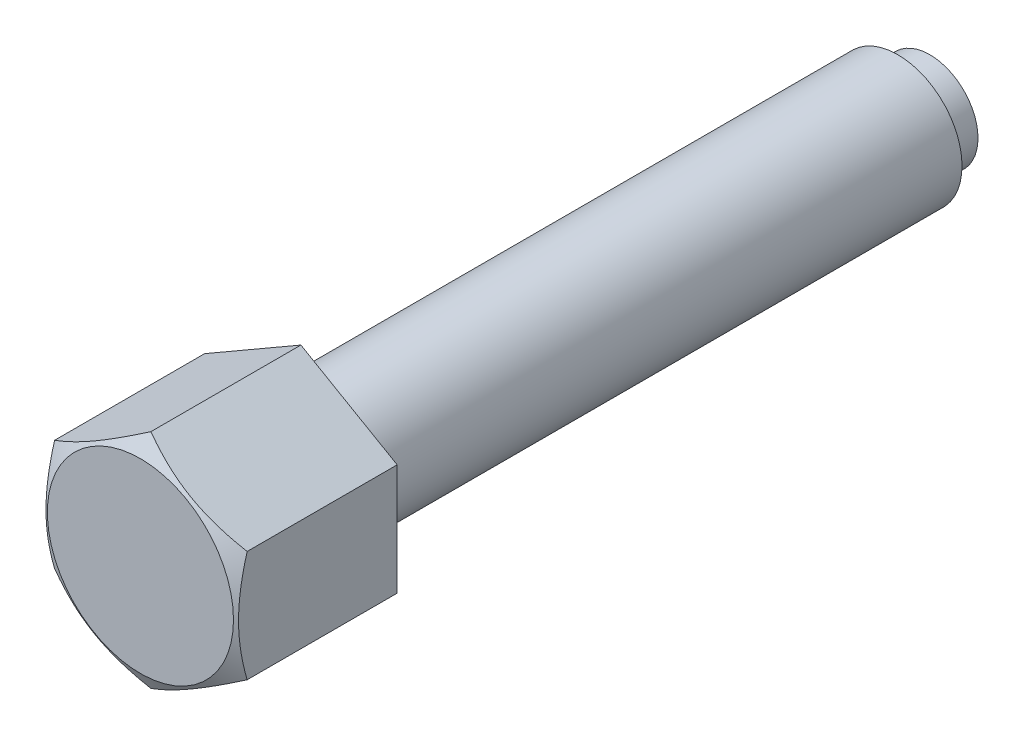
ISO-10303-21;
HEADER;
FILE_DESCRIPTION(('STEP AP214'),'2;1');
FILE_NAME('part.step','',(''),(''),'','','');
FILE_SCHEMA(('AUTOMOTIVE_DESIGN { 1 0 10303 214 1 1 1 1 }'));
ENDSEC;
DATA;
#1=APPLICATION_CONTEXT('core data for automotive mechanical design processes');
#2=APPLICATION_PROTOCOL_DEFINITION('international standard','automotive_design',2000,#1);
#3=PRODUCT_CONTEXT('',#1,'mechanical');
#4=PRODUCT('Part','Part','',(#3));
#5=PRODUCT_RELATED_PRODUCT_CATEGORY('part','',(#4));
#6=PRODUCT_DEFINITION_FORMATION('','',#4);
#7=PRODUCT_DEFINITION_CONTEXT('part definition',#1,'design');
#8=PRODUCT_DEFINITION('design','',#6,#7);
#9=PRODUCT_DEFINITION_SHAPE('','',#8);
#10=(LENGTH_UNIT() NAMED_UNIT(*) SI_UNIT(.MILLI.,.METRE.));
#11=(NAMED_UNIT(*) PLANE_ANGLE_UNIT() SI_UNIT($,.RADIAN.));
#12=(NAMED_UNIT(*) SI_UNIT($,.STERADIAN.) SOLID_ANGLE_UNIT());
#13=UNCERTAINTY_MEASURE_WITH_UNIT(LENGTH_MEASURE(1.E-05),#10,'distance_accuracy_value','');
#14=(GEOMETRIC_REPRESENTATION_CONTEXT(3) GLOBAL_UNCERTAINTY_ASSIGNED_CONTEXT((#13)) GLOBAL_UNIT_ASSIGNED_CONTEXT((#10,
#11,#12)) REPRESENTATION_CONTEXT('',''));
#15=CARTESIAN_POINT('',(0.,0.,0.));
#16=DIRECTION('',(0.,0.,1.));
#17=DIRECTION('',(1.,0.,0.));
#18=AXIS2_PLACEMENT_3D('',#15,#16,#17);
#19=CARTESIAN_POINT('',(0.,17.3205080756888,95.));
#20=DIRECTION('',(-0.5,-0.86602540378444,0.));
#21=DIRECTION('',(0.86602540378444,-0.5,0.));
#22=AXIS2_PLACEMENT_3D('',#19,#20,#21);
#23=PLANE('',#22);
#24=CARTESIAN_POINT('',(15.0002,8.66013856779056,123.371512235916));
#25=CARTESIAN_POINT('',(14.6705058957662,8.85048754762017,123.481403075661));
#26=CARTESIAN_POINT('',(14.3395258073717,9.04157899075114,123.586307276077));
#27=CARTESIAN_POINT('',(13.674911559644,9.425294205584,123.784756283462));
#28=CARTESIAN_POINT('',(13.3412765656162,9.61791845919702,123.878297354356));
#29=CARTESIAN_POINT('',(12.6707077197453,10.0050715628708,124.052762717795));
#30=CARTESIAN_POINT('',(12.333767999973,10.199603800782,124.133657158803));
#31=CARTESIAN_POINT('',(11.6575472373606,10.5900200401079,124.281092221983));
#32=CARTESIAN_POINT('',(11.3182663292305,10.7859039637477,124.347633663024));
#33=CARTESIAN_POINT('',(10.6460568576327,11.1740042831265,124.463532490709));
#34=CARTESIAN_POINT('',(10.3131781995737,11.3661918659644,124.513273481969));
#35=CARTESIAN_POINT('',(9.6458955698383,11.7514476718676,124.596678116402));
#36=CARTESIAN_POINT('',(9.3114915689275,11.9445159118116,124.630341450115));
#37=CARTESIAN_POINT('',(8.64212181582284,12.3309767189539,124.680740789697));
#38=CARTESIAN_POINT('',(8.30715720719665,12.5243686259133,124.697496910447));
#39=CARTESIAN_POINT('',(7.63691878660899,12.9113309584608,124.713721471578));
#40=CARTESIAN_POINT('',(7.30164498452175,13.1049013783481,124.713190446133));
#41=CARTESIAN_POINT('',(6.6748531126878,13.4667798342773,124.696048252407));
#42=CARTESIAN_POINT('',(6.38329037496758,13.6351136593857,124.681528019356));
#43=CARTESIAN_POINT('',(5.80083556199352,13.9713941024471,124.639687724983));
#44=CARTESIAN_POINT('',(5.50994353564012,14.1393406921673,124.612366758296));
#45=CARTESIAN_POINT('',(4.92898814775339,14.4747554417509,124.545401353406));
#46=CARTESIAN_POINT('',(4.63892567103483,14.6422230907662,124.505746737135));
#47=CARTESIAN_POINT('',(4.06016058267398,14.9763732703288,124.414809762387));
#48=CARTESIAN_POINT('',(3.77145806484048,15.1430557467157,124.363526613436));
#49=CARTESIAN_POINT('',(2.89508556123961,15.6490296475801,124.190938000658));
#50=CARTESIAN_POINT('',(2.30995340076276,15.9868558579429,124.052423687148));
#51=CARTESIAN_POINT('',(1.14841408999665,16.657470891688,123.73805289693));
#52=CARTESIAN_POINT('',(0.571992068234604,16.9902683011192,123.562270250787));
#53=CARTESIAN_POINT('',(-0.000199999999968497,17.3206235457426,123.371512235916));
#54=B_SPLINE_CURVE_WITH_KNOTS('',3,(#24,#25,#26,#27,#28,#29,#30,#31,#32,#33,#34,#35,#36,#37,#38,
#39,#40,#41,#42,#43,#44,#45,#46,#47,#48,#49,#50,#51,#52,#53),.UNSPECIFIED.,.F.,.F.,(4,2,2,2,2,2,
2,2,2,2,2,2,2,2,4),(0.,1.18875411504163,2.37789802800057,3.56980778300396,4.76164951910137,
5.9240737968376,7.08652044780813,8.24758247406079,9.40860862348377,10.4193068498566,
11.4300765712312,12.4416826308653,13.4533574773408,15.5211962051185,17.5849760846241),.UNSPECIFIED.);
#55=CARTESIAN_POINT('',(15.,8.66025403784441,123.37157890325));
#56=VERTEX_POINT('',#55);
#57=CARTESIAN_POINT('',(0.,17.3205080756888,123.37157890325));
#58=VERTEX_POINT('',#57);
#59=EDGE_CURVE('E29',#56,#58,#54,.T.);
#60=ORIENTED_EDGE('',*,*,#59,.F.);
#61=DIRECTION('',(0.,0.,1.));
#62=VECTOR('',#61,1.);
#63=CARTESIAN_POINT('',(15.,8.66025403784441,95.));
#64=LINE('',#63,#62);
#65=CARTESIAN_POINT('',(15.,8.66025403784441,100.));
#66=VERTEX_POINT('',#65);
#67=EDGE_CURVE('E96',#66,#56,#64,.T.);
#68=ORIENTED_EDGE('',*,*,#67,.F.);
#69=DIRECTION('',(0.86602540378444,-0.5,0.));
#70=VECTOR('',#69,1.);
#71=CARTESIAN_POINT('',(15.,8.66025403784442,100.));
#72=LINE('',#71,#70);
#73=CARTESIAN_POINT('',(0.,17.3205080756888,100.));
#74=VERTEX_POINT('',#73);
#75=EDGE_CURVE('E110',#74,#66,#72,.T.);
#76=ORIENTED_EDGE('',*,*,#75,.F.);
#77=DIRECTION('',(0.,0.,1.));
#78=VECTOR('',#77,1.);
#79=CARTESIAN_POINT('',(0.,17.3205080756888,95.));
#80=LINE('',#79,#78);
#81=EDGE_CURVE('E36',#74,#58,#80,.T.);
#82=ORIENTED_EDGE('',*,*,#81,.T.);
#83=EDGE_LOOP('',(#60,#68,#76,#82));
#84=FACE_BOUND('',#83,.T.);
#85=ADVANCED_FACE('F14',(#84),#23,.F.);
#86=CARTESIAN_POINT('',(15.,8.66025403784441,95.));
#87=DIRECTION('',(-1.,0.,0.));
#88=DIRECTION('',(0.,-1.,0.));
#89=AXIS2_PLACEMENT_3D('',#86,#87,#88);
#90=PLANE('',#89);
#91=CARTESIAN_POINT('',(15.,-23.3021585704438,117.371676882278));
#92=CARTESIAN_POINT('',(15.,-22.9744289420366,117.530774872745));
#93=CARTESIAN_POINT('',(15.,-22.6463158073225,117.68908249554));
#94=CARTESIAN_POINT('',(15.,-21.9892425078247,118.003938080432));
#95=CARTESIAN_POINT('',(15.,-21.6602823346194,118.160486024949));
#96=CARTESIAN_POINT('',(15.,-20.6719241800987,118.627262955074));
#97=CARTESIAN_POINT('',(15.,-20.0111448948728,118.934578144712));
#98=CARTESIAN_POINT('',(15.,-18.681600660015,119.541233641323));
#99=CARTESIAN_POINT('',(15.,-18.0128118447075,119.840521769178));
#100=CARTESIAN_POINT('',(15.,-16.6699294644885,120.426907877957));
#101=CARTESIAN_POINT('',(15.,-15.9958361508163,120.71400643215));
#102=CARTESIAN_POINT('',(15.,-14.6193622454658,121.281827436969));
#103=CARTESIAN_POINT('',(15.,-13.9167717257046,121.562043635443));
#104=CARTESIAN_POINT('',(15.,-12.5033805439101,122.101365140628));
#105=CARTESIAN_POINT('',(15.,-11.7925789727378,122.360468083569));
#106=CARTESIAN_POINT('',(15.,-10.3629755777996,122.850786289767));
#107=CARTESIAN_POINT('',(15.,-9.64419315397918,123.082057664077));
#108=CARTESIAN_POINT('',(15.,-8.19624965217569,123.509330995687));
#109=CARTESIAN_POINT('',(15.,-7.46709190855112,123.705344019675));
#110=CARTESIAN_POINT('',(15.,-6.36746139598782,123.965310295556));
#111=CARTESIAN_POINT('',(15.,-6.00094855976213,124.046114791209));
#112=CARTESIAN_POINT('',(15.,-5.26541113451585,124.195413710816));
#113=CARTESIAN_POINT('',(15.,-4.89638659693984,124.263908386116));
#114=CARTESIAN_POINT('',(15.,-4.15607644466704,124.387381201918));
#115=CARTESIAN_POINT('',(15.,-3.78479085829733,124.442359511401));
#116=CARTESIAN_POINT('',(15.,-3.04035132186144,124.537703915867));
#117=CARTESIAN_POINT('',(15.,-2.6671974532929,124.578070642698));
#118=CARTESIAN_POINT('',(15.,-1.92443022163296,124.642882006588));
#119=CARTESIAN_POINT('',(15.,-1.55483457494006,124.667528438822));
#120=CARTESIAN_POINT('',(15.,-0.814932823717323,124.701167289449));
#121=CARTESIAN_POINT('',(15.,-0.444626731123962,124.710159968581));
#122=CARTESIAN_POINT('',(15.,0.296035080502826,124.712277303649));
#123=CARTESIAN_POINT('',(15.,0.666390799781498,124.705401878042));
#124=CARTESIAN_POINT('',(15.,1.40648151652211,124.675951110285));
#125=CARTESIAN_POINT('',(15.,1.77621648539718,124.653375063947));
#126=CARTESIAN_POINT('',(15.,2.66358936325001,124.580830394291));
#127=CARTESIAN_POINT('',(15.,3.18063448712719,124.52348000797));
#128=CARTESIAN_POINT('',(15.,4.21091672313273,124.381189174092));
#129=CARTESIAN_POINT('',(15.,4.72415331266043,124.296245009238));
#130=CARTESIAN_POINT('',(15.,5.74631863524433,124.101788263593));
#131=CARTESIAN_POINT('',(15.,6.25524371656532,123.992256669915));
#132=CARTESIAN_POINT('',(15.,7.26800314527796,123.751969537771));
#133=CARTESIAN_POINT('',(15.,7.771837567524,123.621214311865));
#134=CARTESIAN_POINT('',(15.,8.78554955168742,123.33855845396));
#135=CARTESIAN_POINT('',(15.,9.29531356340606,123.186253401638));
#136=CARTESIAN_POINT('',(15.,10.3098201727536,122.865833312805));
#137=CARTESIAN_POINT('',(15.,10.8145627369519,122.697718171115));
#138=CARTESIAN_POINT('',(15.,11.8192749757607,122.34835373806));
#139=CARTESIAN_POINT('',(15.,12.3192461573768,122.16710876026));
#140=CARTESIAN_POINT('',(15.,13.3150402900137,121.793624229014));
#141=CARTESIAN_POINT('',(15.,13.8108632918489,121.601384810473));
#142=CARTESIAN_POINT('',(15.,14.9898051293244,121.131641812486));
#143=CARTESIAN_POINT('',(15.,15.6712346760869,120.84990466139));
#144=CARTESIAN_POINT('',(15.,17.0282247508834,120.272593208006));
#145=CARTESIAN_POINT('',(15.,17.7037848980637,119.977018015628));
#146=CARTESIAN_POINT('',(15.,19.0501440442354,119.374831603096));
#147=CARTESIAN_POINT('',(15.,19.720941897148,119.068217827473));
#148=CARTESIAN_POINT('',(15.,21.058423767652,118.446206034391));
#149=CARTESIAN_POINT('',(15.,21.7251078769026,118.13080821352));
#150=CARTESIAN_POINT('',(15.,23.0558018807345,117.492528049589));
#151=CARTESIAN_POINT('',(15.,23.7198079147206,117.169637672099));
#152=CARTESIAN_POINT('',(15.,25.0449427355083,116.51800669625));
#153=CARTESIAN_POINT('',(15.,25.7060715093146,116.189266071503));
#154=CARTESIAN_POINT('',(15.,27.0258097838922,115.526991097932));
#155=CARTESIAN_POINT('',(15.,27.6844196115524,115.193457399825));
#156=CARTESIAN_POINT('',(15.,28.9995758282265,114.522344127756));
#157=CARTESIAN_POINT('',(15.,29.6561222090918,114.184764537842));
#158=CARTESIAN_POINT('',(15.,31.5114137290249,113.224742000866));
#159=CARTESIAN_POINT('',(15.,32.7080977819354,112.598316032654));
#160=CARTESIAN_POINT('',(15.,35.0970376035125,111.336990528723));
#161=CARTESIAN_POINT('',(15.,36.2892932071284,110.702090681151));
#162=CARTESIAN_POINT('',(15.,38.6672972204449,109.427440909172));
#163=CARTESIAN_POINT('',(15.,39.8530544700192,108.787707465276));
#164=CARTESIAN_POINT('',(15.,41.6296063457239,107.824348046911));
#165=CARTESIAN_POINT('',(15.,42.2214266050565,107.502610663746));
#166=CARTESIAN_POINT('',(15.,43.4044517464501,106.858008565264));
#167=CARTESIAN_POINT('',(15.,43.995656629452,106.535143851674));
#168=CARTESIAN_POINT('',(15.,44.5865888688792,106.211780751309));
#169=B_SPLINE_CURVE_WITH_KNOTS('',3,(#91,#92,#93,#94,#95,#96,#97,#98,#99,#100,#101,#102,#103,
#104,#105,#106,#107,#108,#109,#110,#111,#112,#113,#114,#115,#116,#117,#118,#119,#120,#121,#122,
#123,#124,#125,#126,#127,#128,#129,#130,#131,#132,#133,#134,#135,#136,#137,#138,#139,#140,#141,
#142,#143,#144,#145,#146,#147,#148,#149,#150,#151,#152,#153,#154,#155,#156,#157,#158,#159,#160,
#161,#162,#163,#164,#165,#166,#167,#168),.UNSPECIFIED.,.F.,.F.,(4,2,2,2,2,2,2,2,2,2,2,2,2,2,2,2,
2,2,2,2,2,2,2,2,2,2,2,2,2,2,2,2,2,2,2,2,2,2,4),(0.,1.09291610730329,2.18584312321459,
4.37201855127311,6.57002901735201,8.76793599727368,11.0369038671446,13.3061254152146,
15.5706925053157,17.8345475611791,18.9603179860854,20.0860654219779,21.2117987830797,
22.3374834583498,23.4484108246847,24.5593196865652,25.6702342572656,26.7811986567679,
28.3409846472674,29.9009808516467,31.4621875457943,33.0233712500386,34.6191556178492,
36.2149506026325,37.8102236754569,39.4054771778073,41.617393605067,43.8294525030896,
46.0420268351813,48.2545516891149,50.469570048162,52.6845984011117,54.8993288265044,
57.1140679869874,61.1661961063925,65.2184737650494,69.2604259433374,71.2812900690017,
73.3021511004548),.UNSPECIFIED.);
#170=CARTESIAN_POINT('',(15.,-8.66025403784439,123.37157890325));
#171=VERTEX_POINT('',#170);
#172=EDGE_CURVE('E156',#171,#56,#169,.T.);
#173=ORIENTED_EDGE('',*,*,#172,.F.);
#174=DIRECTION('',(0.,0.,1.));
#175=VECTOR('',#174,1.);
#176=CARTESIAN_POINT('',(15.,-8.66025403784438,95.));
#177=LINE('',#176,#175);
#178=CARTESIAN_POINT('',(15.,-8.66025403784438,100.));
#179=VERTEX_POINT('',#178);
#180=EDGE_CURVE('E93',#179,#171,#177,.T.);
#181=ORIENTED_EDGE('',*,*,#180,.F.);
#182=DIRECTION('',(0.,-1.,0.));
#183=VECTOR('',#182,1.);
#184=CARTESIAN_POINT('',(15.,0.,100.));
#185=LINE('',#184,#183);
#186=EDGE_CURVE('E107',#66,#179,#185,.T.);
#187=ORIENTED_EDGE('',*,*,#186,.F.);
#188=ORIENTED_EDGE('',*,*,#67,.T.);
#189=EDGE_LOOP('',(#173,#181,#187,#188));
#190=FACE_BOUND('',#189,.T.);
#191=ADVANCED_FACE('F136',(#190),#90,.F.);
#192=CARTESIAN_POINT('',(0.,-17.3205080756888,95.));
#193=DIRECTION('',(0.5,-0.866025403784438,0.));
#194=DIRECTION('',(0.866025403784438,0.5,0.));
#195=AXIS2_PLACEMENT_3D('',#192,#193,#194);
#196=PLANE('',#195);
#197=ORIENTED_EDGE('',*,*,#180,.T.);
#198=CARTESIAN_POINT('',(15.0002,-8.66013856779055,123.371512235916));
#199=CARTESIAN_POINT('',(14.6705058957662,-8.85048754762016,123.481403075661));
#200=CARTESIAN_POINT('',(14.3395258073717,-9.04157899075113,123.586307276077));
#201=CARTESIAN_POINT('',(13.674911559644,-9.42529420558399,123.784756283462));
#202=CARTESIAN_POINT('',(13.3412765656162,-9.61791845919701,123.878297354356));
#203=CARTESIAN_POINT('',(12.6707077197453,-10.0050715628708,124.052762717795));
#204=CARTESIAN_POINT('',(12.333767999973,-10.199603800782,124.133657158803));
#205=CARTESIAN_POINT('',(11.6575472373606,-10.5900200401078,124.281092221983));
#206=CARTESIAN_POINT('',(11.3182663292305,-10.7859039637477,124.347633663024));
#207=CARTESIAN_POINT('',(10.6460568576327,-11.1740042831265,124.463532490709));
#208=CARTESIAN_POINT('',(10.3131781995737,-11.3661918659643,124.513273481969));
#209=CARTESIAN_POINT('',(9.64589556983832,-11.7514476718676,124.596678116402));
#210=CARTESIAN_POINT('',(9.31149156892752,-11.9445159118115,124.630341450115));
#211=CARTESIAN_POINT('',(8.64212181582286,-12.3309767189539,124.680740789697));
#212=CARTESIAN_POINT('',(8.30715720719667,-12.5243686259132,124.697496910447));
#213=CARTESIAN_POINT('',(7.63691878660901,-12.9113309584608,124.713721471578));
#214=CARTESIAN_POINT('',(7.30164498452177,-13.104901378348,124.713190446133));
#215=CARTESIAN_POINT('',(6.67485311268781,-13.4667798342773,124.696048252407));
#216=CARTESIAN_POINT('',(6.38329037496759,-13.6351136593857,124.681528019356));
#217=CARTESIAN_POINT('',(5.80083556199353,-13.9713941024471,124.639687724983));
#218=CARTESIAN_POINT('',(5.50994353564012,-14.1393406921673,124.612366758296));
#219=CARTESIAN_POINT('',(4.92898814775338,-14.4747554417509,124.545401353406));
#220=CARTESIAN_POINT('',(4.63892567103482,-14.6422230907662,124.505746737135));
#221=CARTESIAN_POINT('',(4.06016058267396,-14.9763732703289,124.414809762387));
#222=CARTESIAN_POINT('',(3.77145806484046,-15.1430557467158,124.363526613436));
#223=CARTESIAN_POINT('',(2.89508556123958,-15.6490296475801,124.190938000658));
#224=CARTESIAN_POINT('',(2.30995340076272,-15.9868558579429,124.052423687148));
#225=CARTESIAN_POINT('',(1.1484140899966,-16.6574708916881,123.73805289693));
#226=CARTESIAN_POINT('',(0.571992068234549,-16.9902683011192,123.562270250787));
#227=CARTESIAN_POINT('',(-0.000200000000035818,-17.3206235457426,123.371512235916));
#228=B_SPLINE_CURVE_WITH_KNOTS('',3,(#198,#199,#200,#201,#202,#203,#204,#205,#206,#207,#208,
#209,#210,#211,#212,#213,#214,#215,#216,#217,#218,#219,#220,#221,#222,#223,#224,#225,#226,#227),
.UNSPECIFIED.,.F.,.F.,(4,2,2,2,2,2,2,2,2,2,2,2,2,2,4),(0.,1.18875411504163,2.37789802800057,
3.56980778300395,4.76164951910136,5.92407379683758,7.08652044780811,8.24758247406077,
9.40860862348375,10.4193068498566,11.4300765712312,12.4416826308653,13.4533574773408,
15.5211962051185,17.5849760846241),.UNSPECIFIED.);
#229=CARTESIAN_POINT('',(0.,-17.3205080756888,123.37157890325));
#230=VERTEX_POINT('',#229);
#231=EDGE_CURVE('E162',#171,#230,#228,.T.);
#232=ORIENTED_EDGE('',*,*,#231,.T.);
#233=DIRECTION('',(0.,0.,1.));
#234=VECTOR('',#233,1.);
#235=CARTESIAN_POINT('',(0.,-17.3205080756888,95.));
#236=LINE('',#235,#234);
#237=CARTESIAN_POINT('',(0.,-17.3205080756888,100.));
#238=VERTEX_POINT('',#237);
#239=EDGE_CURVE('E86',#238,#230,#236,.T.);
#240=ORIENTED_EDGE('',*,*,#239,.F.);
#241=DIRECTION('',(0.866025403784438,0.5,0.));
#242=VECTOR('',#241,1.);
#243=CARTESIAN_POINT('',(15.,-8.66025403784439,100.));
#244=LINE('',#243,#242);
#245=EDGE_CURVE('E105',#238,#179,#244,.T.);
#246=ORIENTED_EDGE('',*,*,#245,.T.);
#247=EDGE_LOOP('',(#197,#232,#240,#246));
#248=FACE_BOUND('',#247,.T.);
#249=ADVANCED_FACE('F142',(#248),#196,.T.);
#250=CARTESIAN_POINT('',(0.,-17.3205080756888,95.));
#251=DIRECTION('',(0.5,0.866025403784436,0.));
#252=DIRECTION('',(-0.866025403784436,0.5,0.));
#253=AXIS2_PLACEMENT_3D('',#250,#251,#252);
#254=PLANE('',#253);
#255=CARTESIAN_POINT('',(-15.0002,-8.66013856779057,123.371512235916));
#256=CARTESIAN_POINT('',(-14.6705058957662,-8.85048754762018,123.481403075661));
#257=CARTESIAN_POINT('',(-14.3395258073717,-9.04157899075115,123.586307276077));
#258=CARTESIAN_POINT('',(-13.674911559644,-9.42529420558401,123.784756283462));
#259=CARTESIAN_POINT('',(-13.3412765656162,-9.61791845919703,123.878297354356));
#260=CARTESIAN_POINT('',(-12.6707077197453,-10.0050715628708,124.052762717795));
#261=CARTESIAN_POINT('',(-12.333767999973,-10.199603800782,124.133657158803));
#262=CARTESIAN_POINT('',(-11.6575472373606,-10.5900200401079,124.281092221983));
#263=CARTESIAN_POINT('',(-11.3182663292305,-10.7859039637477,124.347633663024));
#264=CARTESIAN_POINT('',(-10.6460568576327,-11.1740042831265,124.463532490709));
#265=CARTESIAN_POINT('',(-10.3131781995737,-11.3661918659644,124.513273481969));
#266=CARTESIAN_POINT('',(-9.64589556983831,-11.7514476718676,124.596678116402));
#267=CARTESIAN_POINT('',(-9.31149156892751,-11.9445159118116,124.630341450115));
#268=CARTESIAN_POINT('',(-8.64212181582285,-12.3309767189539,124.680740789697));
#269=CARTESIAN_POINT('',(-8.30715720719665,-12.5243686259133,124.697496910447));
#270=CARTESIAN_POINT('',(-7.636918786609,-12.9113309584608,124.713721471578));
#271=CARTESIAN_POINT('',(-7.30164498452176,-13.1049013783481,124.713190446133));
#272=CARTESIAN_POINT('',(-6.67485311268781,-13.4667798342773,124.696048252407));
#273=CARTESIAN_POINT('',(-6.38329037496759,-13.6351136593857,124.681528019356));
#274=CARTESIAN_POINT('',(-5.80083556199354,-13.9713941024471,124.639687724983));
#275=CARTESIAN_POINT('',(-5.50994353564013,-14.1393406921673,124.612366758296));
#276=CARTESIAN_POINT('',(-4.9289881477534,-14.4747554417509,124.545401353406));
#277=CARTESIAN_POINT('',(-4.63892567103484,-14.6422230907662,124.505746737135));
#278=CARTESIAN_POINT('',(-4.06016058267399,-14.9763732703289,124.414809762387));
#279=CARTESIAN_POINT('',(-3.77145806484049,-15.1430557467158,124.363526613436));
#280=CARTESIAN_POINT('',(-2.89508556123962,-15.6490296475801,124.190938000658));
#281=CARTESIAN_POINT('',(-2.30995340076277,-15.9868558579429,124.052423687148));
#282=CARTESIAN_POINT('',(-1.14841408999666,-16.6574708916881,123.73805289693));
#283=CARTESIAN_POINT('',(-0.571992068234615,-16.9902683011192,123.562270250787));
#284=CARTESIAN_POINT('',(0.00019999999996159,-17.3206235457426,123.371512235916));
#285=B_SPLINE_CURVE_WITH_KNOTS('',3,(#255,#256,#257,#258,#259,#260,#261,#262,#263,#264,#265,
#266,#267,#268,#269,#270,#271,#272,#273,#274,#275,#276,#277,#278,#279,#280,#281,#282,#283,#284),
.UNSPECIFIED.,.F.,.F.,(4,2,2,2,2,2,2,2,2,2,2,2,2,2,4),(0.,1.18875411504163,2.37789802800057,
3.56980778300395,4.76164951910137,5.9240737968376,7.08652044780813,8.24758247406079,
9.40860862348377,10.4193068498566,11.4300765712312,12.4416826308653,13.4533574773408,
15.5211962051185,17.5849760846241),.UNSPECIFIED.);
#286=CARTESIAN_POINT('',(-15.,-8.66025403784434,123.37157890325));
#287=VERTEX_POINT('',#286);
#288=EDGE_CURVE('E80',#287,#230,#285,.T.);
#289=ORIENTED_EDGE('',*,*,#288,.F.);
#290=DIRECTION('',(0.,0.,1.));
#291=VECTOR('',#290,1.);
#292=CARTESIAN_POINT('',(-15.,-8.66025403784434,95.));
#293=LINE('',#292,#291);
#294=CARTESIAN_POINT('',(-15.,-8.66025403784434,100.));
#295=VERTEX_POINT('',#294);
#296=EDGE_CURVE('E79',#295,#287,#293,.T.);
#297=ORIENTED_EDGE('',*,*,#296,.F.);
#298=DIRECTION('',(-0.866025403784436,0.5,0.));
#299=VECTOR('',#298,1.);
#300=CARTESIAN_POINT('',(-1.17961196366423E-13,-17.3205080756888,100.));
#301=LINE('',#300,#299);
#302=EDGE_CURVE('E102',#238,#295,#301,.T.);
#303=ORIENTED_EDGE('',*,*,#302,.F.);
#304=ORIENTED_EDGE('',*,*,#239,.T.);
#305=EDGE_LOOP('',(#289,#297,#303,#304));
#306=FACE_BOUND('',#305,.T.);
#307=ADVANCED_FACE('F238',(#306),#254,.F.);
#308=CARTESIAN_POINT('',(-15.,8.66025403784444,95.));
#309=DIRECTION('',(-1.,0.,0.));
#310=DIRECTION('',(0.,0.,1.));
#311=AXIS2_PLACEMENT_3D('',#308,#309,#310);
#312=PLANE('',#311);
#313=ORIENTED_EDGE('',*,*,#296,.T.);
#314=CARTESIAN_POINT('',(-15.,-23.3021585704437,117.371676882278));
#315=CARTESIAN_POINT('',(-15.,-22.9744289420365,117.530774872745));
#316=CARTESIAN_POINT('',(-15.,-22.6463158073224,117.68908249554));
#317=CARTESIAN_POINT('',(-15.,-21.9892425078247,118.003938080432));
#318=CARTESIAN_POINT('',(-15.,-21.6602823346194,118.160486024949));
#319=CARTESIAN_POINT('',(-15.,-20.6719241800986,118.627262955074));
#320=CARTESIAN_POINT('',(-15.,-20.0111448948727,118.934578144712));
#321=CARTESIAN_POINT('',(-15.,-18.681600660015,119.541233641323));
#322=CARTESIAN_POINT('',(-15.,-18.0128118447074,119.840521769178));
#323=CARTESIAN_POINT('',(-15.,-16.6699294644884,120.426907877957));
#324=CARTESIAN_POINT('',(-15.,-15.9958361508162,120.71400643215));
#325=CARTESIAN_POINT('',(-15.,-14.6193622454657,121.281827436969));
#326=CARTESIAN_POINT('',(-15.,-13.9167717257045,121.562043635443));
#327=CARTESIAN_POINT('',(-15.,-12.5033805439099,122.101365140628));
#328=CARTESIAN_POINT('',(-15.,-11.7925789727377,122.360468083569));
#329=CARTESIAN_POINT('',(-15.,-10.3629755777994,122.850786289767));
#330=CARTESIAN_POINT('',(-15.,-9.64419315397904,123.082057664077));
#331=CARTESIAN_POINT('',(-15.,-8.1962496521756,123.509330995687));
#332=CARTESIAN_POINT('',(-15.,-7.46709190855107,123.705344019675));
#333=CARTESIAN_POINT('',(-15.,-6.36746139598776,123.965310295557));
#334=CARTESIAN_POINT('',(-15.,-6.00094855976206,124.046114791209));
#335=CARTESIAN_POINT('',(-15.,-5.26541113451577,124.195413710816));
#336=CARTESIAN_POINT('',(-15.,-4.89638659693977,124.263908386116));
#337=CARTESIAN_POINT('',(-15.,-4.15607644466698,124.387381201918));
#338=CARTESIAN_POINT('',(-15.,-3.78479085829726,124.442359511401));
#339=CARTESIAN_POINT('',(-15.,-3.04035132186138,124.537703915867));
#340=CARTESIAN_POINT('',(-15.,-2.66719745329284,124.578070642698));
#341=CARTESIAN_POINT('',(-15.,-1.92443022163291,124.642882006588));
#342=CARTESIAN_POINT('',(-15.,-1.55483457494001,124.667528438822));
#343=CARTESIAN_POINT('',(-15.,-0.814932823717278,124.701167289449));
#344=CARTESIAN_POINT('',(-15.,-0.444626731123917,124.710159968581));
#345=CARTESIAN_POINT('',(-15.,0.296035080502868,124.712277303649));
#346=CARTESIAN_POINT('',(-15.,0.666390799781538,124.705401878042));
#347=CARTESIAN_POINT('',(-15.,1.40648151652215,124.675951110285));
#348=CARTESIAN_POINT('',(-15.,1.77621648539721,124.653375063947));
#349=CARTESIAN_POINT('',(-15.,2.66358936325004,124.580830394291));
#350=CARTESIAN_POINT('',(-15.,3.18063448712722,124.52348000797));
#351=CARTESIAN_POINT('',(-15.,4.21091672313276,124.381189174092));
#352=CARTESIAN_POINT('',(-15.,4.72415331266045,124.296245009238));
#353=CARTESIAN_POINT('',(-15.,5.74631863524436,124.101788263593));
#354=CARTESIAN_POINT('',(-15.,6.25524371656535,123.992256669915));
#355=CARTESIAN_POINT('',(-15.,7.268003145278,123.751969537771));
#356=CARTESIAN_POINT('',(-15.,7.77183756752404,123.621214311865));
#357=CARTESIAN_POINT('',(-15.,8.78554955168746,123.33855845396));
#358=CARTESIAN_POINT('',(-15.,9.29531356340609,123.186253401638));
#359=CARTESIAN_POINT('',(-15.,10.3098201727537,122.865833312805));
#360=CARTESIAN_POINT('',(-15.,10.8145627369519,122.697718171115));
#361=CARTESIAN_POINT('',(-15.,11.8192749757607,122.34835373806));
#362=CARTESIAN_POINT('',(-15.,12.3192461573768,122.16710876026));
#363=CARTESIAN_POINT('',(-15.,13.3150402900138,121.793624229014));
#364=CARTESIAN_POINT('',(-15.,13.810863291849,121.601384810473));
#365=CARTESIAN_POINT('',(-15.,14.9898051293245,121.131641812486));
#366=CARTESIAN_POINT('',(-15.,15.6712346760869,120.84990466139));
#367=CARTESIAN_POINT('',(-15.,17.0282247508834,120.272593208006));
#368=CARTESIAN_POINT('',(-15.,17.7037848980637,119.977018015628));
#369=CARTESIAN_POINT('',(-15.,19.0501440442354,119.374831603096));
#370=CARTESIAN_POINT('',(-15.,19.720941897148,119.068217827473));
#371=CARTESIAN_POINT('',(-15.,21.058423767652,118.446206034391));
#372=CARTESIAN_POINT('',(-15.,21.7251078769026,118.13080821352));
#373=CARTESIAN_POINT('',(-15.,23.0558018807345,117.492528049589));
#374=CARTESIAN_POINT('',(-15.,23.7198079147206,117.169637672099));
#375=CARTESIAN_POINT('',(-15.,25.0449427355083,116.51800669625));
#376=CARTESIAN_POINT('',(-15.,25.7060715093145,116.189266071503));
#377=CARTESIAN_POINT('',(-15.,27.0258097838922,115.526991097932));
#378=CARTESIAN_POINT('',(-15.,27.6844196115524,115.193457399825));
#379=CARTESIAN_POINT('',(-15.,28.9995758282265,114.522344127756));
#380=CARTESIAN_POINT('',(-15.,29.6561222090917,114.184764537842));
#381=CARTESIAN_POINT('',(-15.,31.5114137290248,113.224742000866));
#382=CARTESIAN_POINT('',(-15.,32.7080977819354,112.598316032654));
#383=CARTESIAN_POINT('',(-15.,35.0970376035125,111.336990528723));
#384=CARTESIAN_POINT('',(-15.,36.2892932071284,110.702090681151));
#385=CARTESIAN_POINT('',(-15.,38.6672972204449,109.427440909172));
#386=CARTESIAN_POINT('',(-15.,39.8530544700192,108.787707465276));
#387=CARTESIAN_POINT('',(-15.,41.6296063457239,107.824348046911));
#388=CARTESIAN_POINT('',(-15.,42.2214266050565,107.502610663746));
#389=CARTESIAN_POINT('',(-15.,43.4044517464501,106.858008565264));
#390=CARTESIAN_POINT('',(-15.,43.995656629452,106.535143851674));
#391=CARTESIAN_POINT('',(-15.,44.5865888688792,106.211780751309));
#392=B_SPLINE_CURVE_WITH_KNOTS('',3,(#314,#315,#316,#317,#318,#319,#320,#321,#322,#323,#324,
#325,#326,#327,#328,#329,#330,#331,#332,#333,#334,#335,#336,#337,#338,#339,#340,#341,#342,#343,
#344,#345,#346,#347,#348,#349,#350,#351,#352,#353,#354,#355,#356,#357,#358,#359,#360,#361,#362,
#363,#364,#365,#366,#367,#368,#369,#370,#371,#372,#373,#374,#375,#376,#377,#378,#379,#380,#381,
#382,#383,#384,#385,#386,#387,#388,#389,#390,#391),.UNSPECIFIED.,.F.,.F.,(4,2,2,2,2,2,2,2,2,2,2,
2,2,2,2,2,2,2,2,2,2,2,2,2,2,2,2,2,2,2,2,2,2,2,2,2,2,2,4),(0.,1.09291610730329,2.1858431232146,
4.37201855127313,6.57002901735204,8.76793599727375,11.0369038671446,13.3061254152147,
15.5706925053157,17.8345475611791,18.9603179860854,20.0860654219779,21.2117987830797,
22.3374834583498,23.4484108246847,24.5593196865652,25.6702342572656,26.7811986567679,
28.3409846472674,29.9009808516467,31.4621875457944,33.0233712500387,34.6191556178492,
36.2149506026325,37.8102236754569,39.4054771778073,41.617393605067,43.8294525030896,
46.0420268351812,48.2545516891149,50.469570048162,52.6845984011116,54.8993288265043,
57.1140679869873,61.1661961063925,65.2184737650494,69.2604259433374,71.2812900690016,
73.3021511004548),.UNSPECIFIED.);
#393=CARTESIAN_POINT('',(-15.,8.66025403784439,123.37157890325));
#394=VERTEX_POINT('',#393);
#395=EDGE_CURVE('E67',#287,#394,#392,.T.);
#396=ORIENTED_EDGE('',*,*,#395,.T.);
#397=DIRECTION('',(0.,0.,1.));
#398=VECTOR('',#397,1.);
#399=CARTESIAN_POINT('',(-15.,8.66025403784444,95.));
#400=LINE('',#399,#398);
#401=CARTESIAN_POINT('',(-15.,8.66025403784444,100.));
#402=VERTEX_POINT('',#401);
#403=EDGE_CURVE('E76',#402,#394,#400,.T.);
#404=ORIENTED_EDGE('',*,*,#403,.F.);
#405=DIRECTION('',(0.,-1.,0.));
#406=VECTOR('',#405,1.);
#407=CARTESIAN_POINT('',(-15.,0.,100.));
#408=LINE('',#407,#406);
#409=EDGE_CURVE('E100',#402,#295,#408,.T.);
#410=ORIENTED_EDGE('',*,*,#409,.T.);
#411=EDGE_LOOP('',(#313,#396,#404,#410));
#412=FACE_BOUND('',#411,.T.);
#413=ADVANCED_FACE('F75',(#412),#312,.T.);
#414=CARTESIAN_POINT('',(0.,17.3205080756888,95.));
#415=DIRECTION('',(-0.5,0.866025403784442,0.));
#416=DIRECTION('',(-0.866025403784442,-0.5,0.));
#417=AXIS2_PLACEMENT_3D('',#414,#415,#416);
#418=PLANE('',#417);
#419=ORIENTED_EDGE('',*,*,#403,.T.);
#420=CARTESIAN_POINT('',(-15.0002,8.66013856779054,123.371512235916));
#421=CARTESIAN_POINT('',(-14.6705058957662,8.85048754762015,123.481403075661));
#422=CARTESIAN_POINT('',(-14.3395258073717,9.04157899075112,123.586307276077));
#423=CARTESIAN_POINT('',(-13.674911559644,9.42529420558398,123.784756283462));
#424=CARTESIAN_POINT('',(-13.3412765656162,9.617918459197,123.878297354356));
#425=CARTESIAN_POINT('',(-12.6707077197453,10.0050715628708,124.052762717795));
#426=CARTESIAN_POINT('',(-12.333767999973,10.199603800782,124.133657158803));
#427=CARTESIAN_POINT('',(-11.6575472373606,10.5900200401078,124.281092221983));
#428=CARTESIAN_POINT('',(-11.3182663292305,10.7859039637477,124.347633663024));
#429=CARTESIAN_POINT('',(-10.6460568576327,11.1740042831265,124.463532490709));
#430=CARTESIAN_POINT('',(-10.3131781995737,11.3661918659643,124.513273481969));
#431=CARTESIAN_POINT('',(-9.64589556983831,11.7514476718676,124.596678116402));
#432=CARTESIAN_POINT('',(-9.31149156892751,11.9445159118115,124.630341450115));
#433=CARTESIAN_POINT('',(-8.64212181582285,12.3309767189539,124.680740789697));
#434=CARTESIAN_POINT('',(-8.30715720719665,12.5243686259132,124.697496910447));
#435=CARTESIAN_POINT('',(-7.636918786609,12.9113309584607,124.713721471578));
#436=CARTESIAN_POINT('',(-7.30164498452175,13.104901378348,124.713190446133));
#437=CARTESIAN_POINT('',(-6.67485311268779,13.4667798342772,124.696048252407));
#438=CARTESIAN_POINT('',(-6.38329037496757,13.6351136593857,124.681528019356));
#439=CARTESIAN_POINT('',(-5.80083556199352,13.971394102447,124.639687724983));
#440=CARTESIAN_POINT('',(-5.50994353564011,14.1393406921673,124.612366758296));
#441=CARTESIAN_POINT('',(-4.92898814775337,14.4747554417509,124.545401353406));
#442=CARTESIAN_POINT('',(-4.6389256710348,14.6422230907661,124.505746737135));
#443=CARTESIAN_POINT('',(-4.06016058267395,14.9763732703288,124.414809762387));
#444=CARTESIAN_POINT('',(-3.77145806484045,15.1430557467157,124.363526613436));
#445=CARTESIAN_POINT('',(-2.89508556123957,15.6490296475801,124.190938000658));
#446=CARTESIAN_POINT('',(-2.30995340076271,15.9868558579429,124.052423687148));
#447=CARTESIAN_POINT('',(-1.1484140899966,16.657470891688,123.73805289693));
#448=CARTESIAN_POINT('',(-0.571992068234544,16.9902683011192,123.562270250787));
#449=CARTESIAN_POINT('',(0.000200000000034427,17.3206235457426,123.371512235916));
#450=B_SPLINE_CURVE_WITH_KNOTS('',3,(#420,#421,#422,#423,#424,#425,#426,#427,#428,#429,#430,
#431,#432,#433,#434,#435,#436,#437,#438,#439,#440,#441,#442,#443,#444,#445,#446,#447,#448,#449),
.UNSPECIFIED.,.F.,.F.,(4,2,2,2,2,2,2,2,2,2,2,2,2,2,4),(0.,1.18875411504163,2.37789802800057,
3.56980778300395,4.76164951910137,5.92407379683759,7.08652044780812,8.24758247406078,
9.40860862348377,10.4193068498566,11.4300765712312,12.4416826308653,13.4533574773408,
15.5211962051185,17.5849760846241),.UNSPECIFIED.);
#451=EDGE_CURVE('E64',#394,#58,#450,.T.);
#452=ORIENTED_EDGE('',*,*,#451,.T.);
#453=ORIENTED_EDGE('',*,*,#81,.F.);
#454=DIRECTION('',(-0.866025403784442,-0.5,0.));
#455=VECTOR('',#454,1.);
#456=CARTESIAN_POINT('',(1.16226472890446E-13,17.3205080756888,100.));
#457=LINE('',#456,#455);
#458=EDGE_CURVE('E84',#74,#402,#457,.T.);
#459=ORIENTED_EDGE('',*,*,#458,.T.);
#460=EDGE_LOOP('',(#419,#452,#453,#459));
#461=FACE_BOUND('',#460,.T.);
#462=ADVANCED_FACE('F82',(#461),#418,.T.);
#463=CARTESIAN_POINT('',(0.,0.,15.));
#464=DIRECTION('',(0.,0.,1.));
#465=DIRECTION('',(1.,0.,0.));
#466=AXIS2_PLACEMENT_3D('',#463,#464,#465);
#467=SPHERICAL_SURFACE('',#466,15.);
#468=CARTESIAN_POINT('',(0.,0.,2.00961894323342));
#469=DIRECTION('',(0.,0.,1.));
#470=DIRECTION('',(1.,0.,0.));
#471=AXIS2_PLACEMENT_3D('',#468,#469,#470);
#472=CIRCLE('',#471,7.5);
#473=CARTESIAN_POINT('',(7.5,0.,2.00961894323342));
#474=VERTEX_POINT('',#473);
#475=EDGE_CURVE('E9',#474,#474,#472,.T.);
#476=ORIENTED_EDGE('',*,*,#475,.F.);
#477=EDGE_LOOP('',(#476));
#478=FACE_BOUND('',#477,.T.);
#479=ADVANCED_FACE('F16',(#478),#467,.T.);
#480=CARTESIAN_POINT('',(0.,0.,110.));
#481=DIRECTION('',(0.,0.,1.));
#482=DIRECTION('',(1.,0.,0.));
#483=AXIS2_PLACEMENT_3D('',#480,#481,#482);
#484=CYLINDRICAL_SURFACE('',#483,7.5);
#485=ORIENTED_EDGE('',*,*,#475,.T.);
#486=EDGE_LOOP('',(#485));
#487=FACE_BOUND('',#486,.T.);
#488=CARTESIAN_POINT('',(0.,0.,7.));
#489=DIRECTION('',(0.,0.,1.));
#490=DIRECTION('',(1.,0.,0.));
#491=AXIS2_PLACEMENT_3D('',#488,#489,#490);
#492=CIRCLE('',#491,7.5);
#493=CARTESIAN_POINT('',(7.5,0.,7.));
#494=VERTEX_POINT('',#493);
#495=EDGE_CURVE('E22',#494,#494,#492,.T.);
#496=ORIENTED_EDGE('',*,*,#495,.F.);
#497=EDGE_LOOP('',(#496));
#498=FACE_BOUND('',#497,.T.);
#499=ADVANCED_FACE('F123',(#487,#498),#484,.T.);
#500=CARTESIAN_POINT('',(7.5,0.,7.));
#501=DIRECTION('',(0.,0.,1.));
#502=DIRECTION('',(1.,0.,0.));
#503=AXIS2_PLACEMENT_3D('',#500,#501,#502);
#504=PLANE('',#503);
#505=CARTESIAN_POINT('',(0.,0.,7.));
#506=DIRECTION('',(0.,0.,1.));
#507=DIRECTION('',(1.,0.,0.));
#508=AXIS2_PLACEMENT_3D('',#505,#506,#507);
#509=CIRCLE('',#508,10.);
#510=CARTESIAN_POINT('',(10.,0.,7.));
#511=VERTEX_POINT('',#510);
#512=EDGE_CURVE('E116',#511,#511,#509,.T.);
#513=ORIENTED_EDGE('',*,*,#512,.F.);
#514=EDGE_LOOP('',(#513));
#515=FACE_BOUND('',#514,.T.);
#516=ORIENTED_EDGE('',*,*,#495,.T.);
#517=EDGE_LOOP('',(#516));
#518=FACE_BOUND('',#517,.T.);
#519=ADVANCED_FACE('F121',(#515,#518),#504,.F.);
#520=CARTESIAN_POINT('',(0.,0.,110.));
#521=DIRECTION('',(0.,0.,1.));
#522=DIRECTION('',(1.,0.,0.));
#523=AXIS2_PLACEMENT_3D('',#520,#521,#522);
#524=CYLINDRICAL_SURFACE('',#523,10.);
#525=CARTESIAN_POINT('',(0.,0.,100.));
#526=DIRECTION('',(0.,0.,1.));
#527=DIRECTION('',(1.,0.,0.));
#528=AXIS2_PLACEMENT_3D('',#525,#526,#527);
#529=CIRCLE('',#528,10.);
#530=CARTESIAN_POINT('',(10.,0.,100.));
#531=VERTEX_POINT('',#530);
#532=EDGE_CURVE('E113',#531,#531,#529,.T.);
#533=ORIENTED_EDGE('',*,*,#532,.F.);
#534=EDGE_LOOP('',(#533));
#535=FACE_BOUND('',#534,.T.);
#536=ORIENTED_EDGE('',*,*,#512,.T.);
#537=EDGE_LOOP('',(#536));
#538=FACE_BOUND('',#537,.T.);
#539=ADVANCED_FACE('F131',(#535,#538),#524,.T.);
#540=CARTESIAN_POINT('',(10.,0.,100.));
#541=DIRECTION('',(0.,0.,1.));
#542=DIRECTION('',(1.,0.,0.));
#543=AXIS2_PLACEMENT_3D('',#540,#541,#542);
#544=PLANE('',#543);
#545=ORIENTED_EDGE('',*,*,#458,.F.);
#546=ORIENTED_EDGE('',*,*,#75,.T.);
#547=ORIENTED_EDGE('',*,*,#186,.T.);
#548=ORIENTED_EDGE('',*,*,#245,.F.);
#549=ORIENTED_EDGE('',*,*,#302,.T.);
#550=ORIENTED_EDGE('',*,*,#409,.F.);
#551=EDGE_LOOP('',(#545,#546,#547,#548,#549,#550));
#552=FACE_BOUND('',#551,.T.);
#553=ORIENTED_EDGE('',*,*,#532,.T.);
#554=EDGE_LOOP('',(#553));
#555=FACE_BOUND('',#554,.T.);
#556=ADVANCED_FACE('F177',(#552,#555),#544,.F.);
#557=CARTESIAN_POINT('',(0.,0.,125.));
#558=DIRECTION('',(0.,0.,-1.));
#559=DIRECTION('',(-1.,0.,0.));
#560=AXIS2_PLACEMENT_3D('',#557,#558,#559);
#561=CONICAL_SURFACE('',#560,14.5,1.0471975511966);
#562=CARTESIAN_POINT('',(0.,0.,125.));
#563=DIRECTION('',(0.,0.,1.));
#564=DIRECTION('',(1.,0.,0.));
#565=AXIS2_PLACEMENT_3D('',#562,#563,#564);
#566=CIRCLE('',#565,14.5);
#567=CARTESIAN_POINT('',(14.5,0.,125.));
#568=VERTEX_POINT('',#567);
#569=EDGE_CURVE('E70',#568,#568,#566,.T.);
#570=ORIENTED_EDGE('',*,*,#569,.F.);
#571=EDGE_LOOP('',(#570));
#572=FACE_BOUND('',#571,.T.);
#573=ORIENTED_EDGE('',*,*,#59,.T.);
#574=ORIENTED_EDGE('',*,*,#451,.F.);
#575=ORIENTED_EDGE('',*,*,#395,.F.);
#576=ORIENTED_EDGE('',*,*,#288,.T.);
#577=ORIENTED_EDGE('',*,*,#231,.F.);
#578=ORIENTED_EDGE('',*,*,#172,.T.);
#579=EDGE_LOOP('',(#573,#574,#575,#576,#577,#578));
#580=FACE_BOUND('',#579,.T.);
#581=ADVANCED_FACE('F66',(#572,#580),#561,.T.);
#582=CARTESIAN_POINT('',(0.,0.,125.));
#583=DIRECTION('',(0.,0.,1.));
#584=DIRECTION('',(1.,0.,0.));
#585=AXIS2_PLACEMENT_3D('',#582,#583,#584);
#586=PLANE('',#585);
#587=ORIENTED_EDGE('',*,*,#569,.T.);
#588=EDGE_LOOP('',(#587));
#589=FACE_BOUND('',#588,.T.);
#590=ADVANCED_FACE('F173',(#589),#586,.T.);
#591=CLOSED_SHELL('',(#85,#191,#249,#307,#413,#462,#479,#499,#519,#539,#556,#581,#590));
#592=MANIFOLD_SOLID_BREP('B1',#591);
#593=ADVANCED_BREP_SHAPE_REPRESENTATION('',(#18,#592),#14);
#594=SHAPE_DEFINITION_REPRESENTATION(#9,#593);
ENDSEC;
END-ISO-10303-21;
